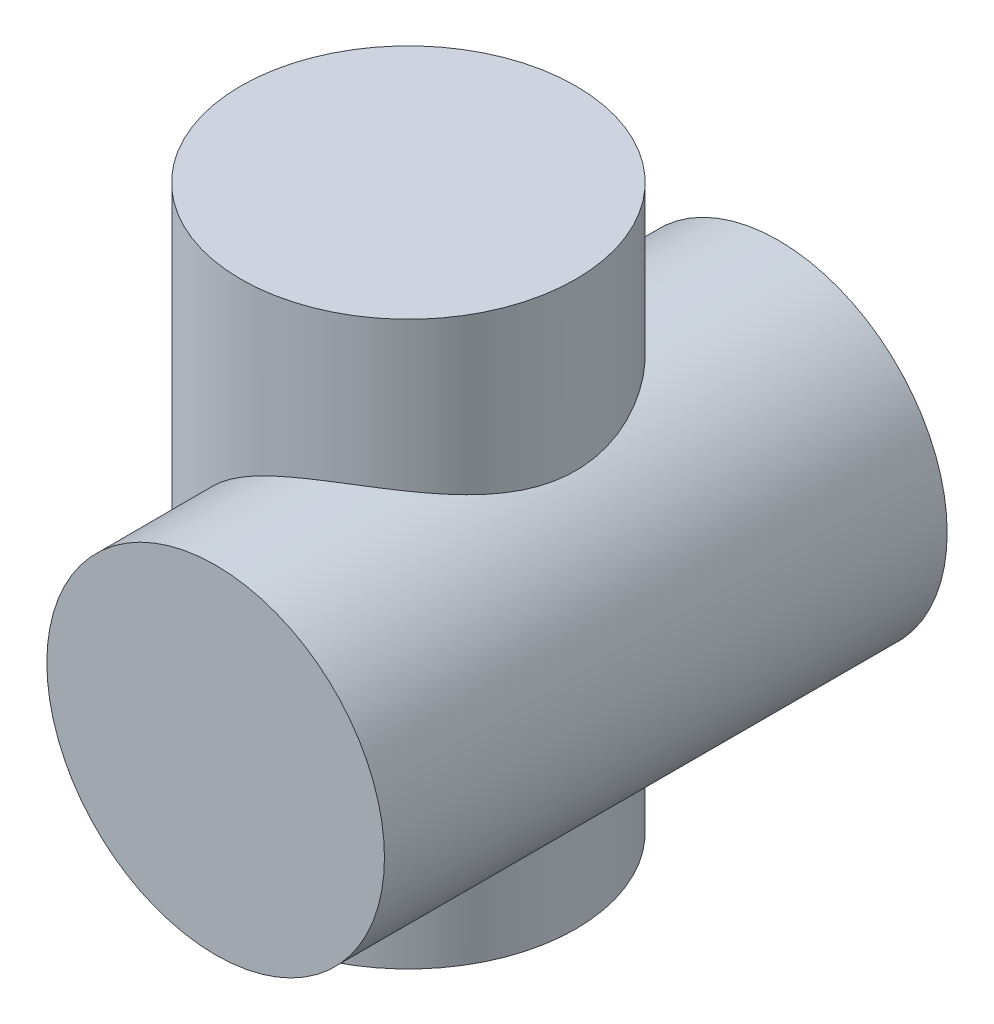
ISO-10303-21;
HEADER;
FILE_DESCRIPTION(('STEP AP214'),'2;1');
FILE_NAME('part.step','',(''),(''),'','','');
FILE_SCHEMA(('AUTOMOTIVE_DESIGN { 1 0 10303 214 1 1 1 1 }'));
ENDSEC;
DATA;
#1=APPLICATION_CONTEXT('core data for automotive mechanical design processes');
#2=APPLICATION_PROTOCOL_DEFINITION('international standard','automotive_design',2000,#1);
#3=PRODUCT_CONTEXT('',#1,'mechanical');
#4=PRODUCT('Part','Part','',(#3));
#5=PRODUCT_RELATED_PRODUCT_CATEGORY('part','',(#4));
#6=PRODUCT_DEFINITION_FORMATION('','',#4);
#7=PRODUCT_DEFINITION_CONTEXT('part definition',#1,'design');
#8=PRODUCT_DEFINITION('design','',#6,#7);
#9=PRODUCT_DEFINITION_SHAPE('','',#8);
#10=(LENGTH_UNIT() NAMED_UNIT(*) SI_UNIT(.MILLI.,.METRE.));
#11=(NAMED_UNIT(*) PLANE_ANGLE_UNIT() SI_UNIT($,.RADIAN.));
#12=(NAMED_UNIT(*) SI_UNIT($,.STERADIAN.) SOLID_ANGLE_UNIT());
#13=UNCERTAINTY_MEASURE_WITH_UNIT(LENGTH_MEASURE(1.E-05),#10,'distance_accuracy_value','');
#14=(GEOMETRIC_REPRESENTATION_CONTEXT(3) GLOBAL_UNCERTAINTY_ASSIGNED_CONTEXT((#13)) GLOBAL_UNIT_ASSIGNED_CONTEXT((#10,
#11,#12)) REPRESENTATION_CONTEXT('',''));
#15=CARTESIAN_POINT('',(0.,0.,0.));
#16=DIRECTION('',(0.,0.,1.));
#17=DIRECTION('',(1.,0.,0.));
#18=AXIS2_PLACEMENT_3D('',#15,#16,#17);
#19=CARTESIAN_POINT('',(0.,0.,50.));
#20=DIRECTION('',(0.,0.,-1.));
#21=DIRECTION('',(-1.,0.,0.));
#22=AXIS2_PLACEMENT_3D('',#19,#20,#21);
#23=CYLINDRICAL_SURFACE('',#22,15.);
#24=CARTESIAN_POINT('',(0.,0.,0.));
#25=DIRECTION('',(0.,0.,1.));
#26=DIRECTION('',(1.,0.,0.));
#27=AXIS2_PLACEMENT_3D('',#24,#25,#26);
#28=CIRCLE('',#27,15.);
#29=CARTESIAN_POINT('',(15.,0.,0.));
#30=VERTEX_POINT('',#29);
#31=EDGE_CURVE('E43',#30,#30,#28,.T.);
#32=ORIENTED_EDGE('',*,*,#31,.T.);
#33=EDGE_LOOP('',(#32));
#34=FACE_BOUND('',#33,.T.);
#35=CARTESIAN_POINT('',(0.,0.,50.));
#36=DIRECTION('',(0.,0.,1.));
#37=DIRECTION('',(1.,0.,0.));
#38=AXIS2_PLACEMENT_3D('',#35,#36,#37);
#39=CIRCLE('',#38,15.);
#40=CARTESIAN_POINT('',(15.,0.,50.));
#41=VERTEX_POINT('',#40);
#42=EDGE_CURVE('E39',#41,#41,#39,.T.);
#43=ORIENTED_EDGE('',*,*,#42,.F.);
#44=EDGE_LOOP('',(#43));
#45=FACE_BOUND('',#44,.T.);
#46=CARTESIAN_POINT('',(-15.,0.,38.0633261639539));
#47=CARTESIAN_POINT('',(-14.9999962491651,0.401423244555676,38.063333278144));
#48=CARTESIAN_POINT('',(-14.9838596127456,0.802976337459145,38.0721674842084));
#49=CARTESIAN_POINT('',(-14.9195113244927,1.60293446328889,38.1069437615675));
#50=CARTESIAN_POINT('',(-14.8712786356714,2.001337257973,38.132897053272));
#51=CARTESIAN_POINT('',(-14.7431941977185,2.79272154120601,38.200316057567));
#52=CARTESIAN_POINT('',(-14.6632628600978,3.18568678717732,38.2418208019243));
#53=CARTESIAN_POINT('',(-14.4727106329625,3.96239327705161,38.3377583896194));
#54=CARTESIAN_POINT('',(-14.3620936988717,4.34613570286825,38.3921895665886));
#55=CARTESIAN_POINT('',(-14.1120167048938,5.09976516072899,38.5104241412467));
#56=CARTESIAN_POINT('',(-13.9727479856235,5.46972580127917,38.5741645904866));
#57=CARTESIAN_POINT('',(-13.665880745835,6.19673046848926,38.7078473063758));
#58=CARTESIAN_POINT('',(-13.4982689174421,6.55376833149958,38.7777924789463));
#59=CARTESIAN_POINT('',(-13.1356851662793,7.25320417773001,38.9202230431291));
#60=CARTESIAN_POINT('',(-12.9407090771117,7.59559992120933,38.9927088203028));
#61=CARTESIAN_POINT('',(-12.5243113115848,8.26418370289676,39.1364679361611));
#62=CARTESIAN_POINT('',(-12.3028893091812,8.59037154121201,39.2077412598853));
#63=CARTESIAN_POINT('',(-11.8155335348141,9.25066802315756,39.3508391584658));
#64=CARTESIAN_POINT('',(-11.5474484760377,9.58328545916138,39.4222425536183));
#65=CARTESIAN_POINT('',(-10.9826399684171,10.2256800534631,39.5543295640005));
#66=CARTESIAN_POINT('',(-10.6859128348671,10.5354542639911,39.6150117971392));
#67=CARTESIAN_POINT('',(-10.0659494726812,11.1292684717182,39.7206330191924));
#68=CARTESIAN_POINT('',(-9.74275353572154,11.4133462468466,39.7655954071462));
#69=CARTESIAN_POINT('',(-9.07179090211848,11.9535730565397,39.8349699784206));
#70=CARTESIAN_POINT('',(-8.72403372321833,12.2097328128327,39.8593900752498));
#71=CARTESIAN_POINT('',(-8.09840812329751,12.6301034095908,39.879959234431));
#72=CARTESIAN_POINT('',(-7.82527435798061,12.8011247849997,39.8817211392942));
#73=CARTESIAN_POINT('',(-7.26884571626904,13.1250692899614,39.8693841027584));
#74=CARTESIAN_POINT('',(-6.98555307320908,13.2779963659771,39.855288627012));
#75=CARTESIAN_POINT('',(-6.41103039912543,13.5647224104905,39.8096367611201));
#76=CARTESIAN_POINT('',(-6.11980583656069,13.6985341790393,39.7780921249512));
#77=CARTESIAN_POINT('',(-5.53162484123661,13.9464321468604,39.6962303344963));
#78=CARTESIAN_POINT('',(-5.23466826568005,14.0605178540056,39.6459127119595));
#79=CARTESIAN_POINT('',(-4.63680881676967,14.2688651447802,39.525379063));
#80=CARTESIAN_POINT('',(-4.33589679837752,14.3630664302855,39.4551039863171));
#81=CARTESIAN_POINT('',(-3.73385454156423,14.5312083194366,39.2941961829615));
#82=CARTESIAN_POINT('',(-3.43272430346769,14.6051489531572,39.203563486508));
#83=CARTESIAN_POINT('',(-2.83305357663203,14.7332222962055,39.0018469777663));
#84=CARTESIAN_POINT('',(-2.5345136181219,14.7873510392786,38.8907590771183));
#85=CARTESIAN_POINT('',(-1.94282173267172,14.8766586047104,38.648484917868));
#86=CARTESIAN_POINT('',(-1.64966975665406,14.9118375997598,38.517298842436));
#87=CARTESIAN_POINT('',(-1.08325172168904,14.9634244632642,38.2413701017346));
#88=CARTESIAN_POINT('',(-0.809665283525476,14.980550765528,38.0974159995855));
#89=CARTESIAN_POINT('',(-0.271629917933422,14.9999562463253,37.7925023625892));
#90=CARTESIAN_POINT('',(-0.00718067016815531,15.0022359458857,37.6315434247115));
#91=CARTESIAN_POINT('',(0.511018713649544,14.9935328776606,37.2935493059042));
#92=CARTESIAN_POINT('',(0.764767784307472,14.9825487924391,37.116512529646));
#93=CARTESIAN_POINT('',(1.26026781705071,14.9490270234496,36.747367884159));
#94=CARTESIAN_POINT('',(1.50201721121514,14.9264878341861,36.5552580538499));
#95=CARTESIAN_POINT('',(1.99851181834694,14.8685953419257,36.1349265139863));
#96=CARTESIAN_POINT('',(2.25173393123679,14.8320998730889,35.9050613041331));
#97=CARTESIAN_POINT('',(2.74094029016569,14.7495363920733,35.4293483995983));
#98=CARTESIAN_POINT('',(2.97692356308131,14.7034678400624,35.1834998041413));
#99=CARTESIAN_POINT('',(3.65799314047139,14.554553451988,34.4235162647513));
#100=CARTESIAN_POINT('',(4.07610338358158,14.4410117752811,33.8870250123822));
#101=CARTESIAN_POINT('',(4.90294838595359,14.1838351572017,32.6621746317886));
#102=CARTESIAN_POINT('',(5.2964880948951,14.0384595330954,31.9638514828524));
#103=CARTESIAN_POINT('',(5.79967127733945,13.8346122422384,30.874181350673));
#104=CARTESIAN_POINT('',(5.95293428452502,13.7690024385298,30.5037257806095));
#105=CARTESIAN_POINT('',(6.22946729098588,13.6461228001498,29.750316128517));
#106=CARTESIAN_POINT('',(6.35273749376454,13.5888529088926,29.3673621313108));
#107=CARTESIAN_POINT('',(6.57342708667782,13.4835372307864,28.5722296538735));
#108=CARTESIAN_POINT('',(6.66928579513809,13.4360801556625,28.1595382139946));
#109=CARTESIAN_POINT('',(6.8256221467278,13.3573417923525,27.3259387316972));
#110=CARTESIAN_POINT('',(6.8860992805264,13.326060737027,26.9050305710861));
#111=CARTESIAN_POINT('',(6.9707738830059,13.2819656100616,26.0590181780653));
#112=CARTESIAN_POINT('',(6.99500692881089,13.2691334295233,25.6339184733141));
#113=CARTESIAN_POINT('',(7.00692743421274,13.2628441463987,24.7830865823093));
#114=CARTESIAN_POINT('',(6.9946185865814,13.2693850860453,24.3573544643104));
#115=CARTESIAN_POINT('',(6.93704208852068,13.2995604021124,23.5562115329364));
#116=CARTESIAN_POINT('',(6.89557198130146,13.3212233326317,23.1804450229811));
#117=CARTESIAN_POINT('',(6.7843862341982,13.3781913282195,22.4341996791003));
#118=CARTESIAN_POINT('',(6.71467260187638,13.4134954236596,22.0637204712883));
#119=CARTESIAN_POINT('',(6.54766956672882,13.495801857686,21.3301646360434));
#120=CARTESIAN_POINT('',(6.4503646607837,13.5428107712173,20.96709229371));
#121=CARTESIAN_POINT('',(6.22903506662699,13.6460255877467,20.2505316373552));
#122=CARTESIAN_POINT('',(6.1050087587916,13.702232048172,19.8970439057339));
#123=CARTESIAN_POINT('',(5.82651813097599,13.8230052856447,19.1896869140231));
#124=CARTESIAN_POINT('',(5.67117303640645,13.8877891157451,18.836201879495));
#125=CARTESIAN_POINT('',(5.33373071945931,14.0208492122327,18.142740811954));
#126=CARTESIAN_POINT('',(5.15162155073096,14.0891270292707,17.8027708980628));
#127=CARTESIAN_POINT('',(4.76143938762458,14.225731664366,17.1377511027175));
#128=CARTESIAN_POINT('',(4.55334849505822,14.2940584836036,16.8127117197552));
#129=CARTESIAN_POINT('',(4.11217246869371,14.4271661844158,16.1792965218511));
#130=CARTESIAN_POINT('',(3.87908754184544,14.4919470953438,15.8709205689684));
#131=CARTESIAN_POINT('',(3.36425406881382,14.6205011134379,15.2423830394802));
#132=CARTESIAN_POINT('',(3.07996963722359,14.6835230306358,14.9241359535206));
#133=CARTESIAN_POINT('',(2.4837011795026,14.7960557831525,14.3119784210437));
#134=CARTESIAN_POINT('',(2.17171330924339,14.8455647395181,14.0180713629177));
#135=CARTESIAN_POINT('',(1.52266635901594,14.926092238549,13.4576993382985));
#136=CARTESIAN_POINT('',(1.18565220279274,14.9571430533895,13.191187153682));
#137=CARTESIAN_POINT('',(0.488950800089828,14.9960822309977,12.6878182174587));
#138=CARTESIAN_POINT('',(0.129273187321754,15.003980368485,12.4509489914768));
#139=CARTESIAN_POINT('',(-0.510919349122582,14.9937509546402,12.0680692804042));
#140=CARTESIAN_POINT('',(-0.787121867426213,14.981971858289,11.9146253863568));
#141=CARTESIAN_POINT('',(-1.347765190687,14.9419693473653,11.6260668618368));
#142=CARTESIAN_POINT('',(-1.63220423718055,14.9137494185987,11.4909483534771));
#143=CARTESIAN_POINT('',(-2.20695299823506,14.8395843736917,11.2398343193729));
#144=CARTESIAN_POINT('',(-2.49725904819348,14.7936500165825,11.1238272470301));
#145=CARTESIAN_POINT('',(-3.08144003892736,14.6830885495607,10.9112769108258));
#146=CARTESIAN_POINT('',(-3.37531509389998,14.6184608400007,10.814734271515));
#147=CARTESIAN_POINT('',(-3.96441152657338,14.4698256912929,10.6410791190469));
#148=CARTESIAN_POINT('',(-4.25963425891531,14.3857894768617,10.5639958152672));
#149=CARTESIAN_POINT('',(-4.84828338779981,14.1982241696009,10.4291324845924));
#150=CARTESIAN_POINT('',(-5.14170978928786,14.0946951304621,10.3713524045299));
#151=CARTESIAN_POINT('',(-5.7242436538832,13.8683350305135,10.2743556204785));
#152=CARTESIAN_POINT('',(-6.01334975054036,13.7454979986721,10.2351446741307));
#153=CARTESIAN_POINT('',(-6.58474726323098,13.4811057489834,10.1742116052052));
#154=CARTESIAN_POINT('',(-6.8670386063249,13.3395503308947,10.152489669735));
#155=CARTESIAN_POINT('',(-7.41925227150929,13.0404024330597,10.1252919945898));
#156=CARTESIAN_POINT('',(-7.68928433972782,12.8830297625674,10.119618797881));
#157=CARTESIAN_POINT('',(-8.21891395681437,12.5517736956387,10.1223704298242));
#158=CARTESIAN_POINT('',(-8.47851166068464,12.3778905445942,10.1307950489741));
#159=CARTESIAN_POINT('',(-8.9858713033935,12.0146355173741,10.1600112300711));
#160=CARTESIAN_POINT('',(-9.23363340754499,11.8252638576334,10.1808026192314));
#161=CARTESIAN_POINT('',(-9.71629798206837,11.4319952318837,10.2329454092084));
#162=CARTESIAN_POINT('',(-9.95119550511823,11.2280927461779,10.2643008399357));
#163=CARTESIAN_POINT('',(-10.4382221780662,10.778120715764,10.3405822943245));
#164=CARTESIAN_POINT('',(-10.6883422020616,10.5300901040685,10.3867748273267));
#165=CARTESIAN_POINT('',(-11.1697526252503,10.0179923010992,10.487674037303));
#166=CARTESIAN_POINT('',(-11.4010405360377,9.75392299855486,10.5423818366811));
#167=CARTESIAN_POINT('',(-11.8441708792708,9.21078491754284,10.6576490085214));
#168=CARTESIAN_POINT('',(-12.0559967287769,8.93170366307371,10.7182132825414));
#169=CARTESIAN_POINT('',(-12.4593495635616,8.35984907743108,10.8424801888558));
#170=CARTESIAN_POINT('',(-12.6508726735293,8.06707314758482,10.906183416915));
#171=CARTESIAN_POINT('',(-13.0453207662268,7.41548273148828,11.0454964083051));
#172=CARTESIAN_POINT('',(-13.2441726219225,7.05421292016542,11.1212006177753));
#173=CARTESIAN_POINT('',(-13.6116662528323,6.31604954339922,11.2689742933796));
#174=CARTESIAN_POINT('',(-13.7803170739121,5.93916069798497,11.3410448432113));
#175=CARTESIAN_POINT('',(-14.0863661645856,5.17155328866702,11.4774306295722));
#176=CARTESIAN_POINT('',(-14.223767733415,4.7808361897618,11.5417466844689));
#177=CARTESIAN_POINT('',(-14.4661556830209,3.98776086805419,11.6587472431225));
#178=CARTESIAN_POINT('',(-14.5711438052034,3.5854032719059,11.7114323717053));
#179=CARTESIAN_POINT('',(-14.7484661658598,2.76758721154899,11.8022445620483));
#180=CARTESIAN_POINT('',(-14.8204598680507,2.35203746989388,11.8402192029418));
#181=CARTESIAN_POINT('',(-14.9292519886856,1.5150860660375,11.8981976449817));
#182=CARTESIAN_POINT('',(-14.9660506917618,1.09368445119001,11.9182015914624));
#183=CARTESIAN_POINT('',(-15.0038840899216,0.249077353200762,11.9387744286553));
#184=CARTESIAN_POINT('',(-15.0049425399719,-0.174126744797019,11.9393562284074));
#185=CARTESIAN_POINT('',(-14.9713354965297,-1.01866623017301,11.9210702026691));
#186=CARTESIAN_POINT('',(-14.9366724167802,-1.44000174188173,11.9022036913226));
#187=CARTESIAN_POINT('',(-14.8380513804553,-2.22988360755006,11.8495573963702));
#188=CARTESIAN_POINT('',(-14.7778297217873,-2.59903403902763,11.8176951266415));
#189=CARTESIAN_POINT('',(-14.630335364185,-3.33053814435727,11.7415261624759));
#190=CARTESIAN_POINT('',(-14.5430648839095,-3.69289237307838,11.6972204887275));
#191=CARTESIAN_POINT('',(-14.3422098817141,-4.40901492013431,11.5984523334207));
#192=CARTESIAN_POINT('',(-14.2286102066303,-4.76277816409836,11.543984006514));
#193=CARTESIAN_POINT('',(-13.975965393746,-5.45983966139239,11.4276006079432));
#194=CARTESIAN_POINT('',(-13.8369183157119,-5.80313711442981,11.3656849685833));
#195=CARTESIAN_POINT('',(-13.5236092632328,-6.50142301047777,11.2328284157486));
#196=CARTESIAN_POINT('',(-13.3475643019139,-6.85554933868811,11.1615591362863));
#197=CARTESIAN_POINT('',(-12.9681725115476,-7.54868601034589,11.0175231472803));
#198=CARTESIAN_POINT('',(-12.7648166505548,-7.88769130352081,10.9447559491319));
#199=CARTESIAN_POINT('',(-12.3315964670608,-8.54915902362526,10.8014983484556));
#200=CARTESIAN_POINT('',(-12.1017154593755,-8.87161085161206,10.7310094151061));
#201=CARTESIAN_POINT('',(-11.6164460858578,-9.4981690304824,10.5962128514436));
#202=CARTESIAN_POINT('',(-11.3610547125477,-9.80227321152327,10.5319059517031));
#203=CARTESIAN_POINT('',(-10.8042163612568,-10.4141008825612,10.4086116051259));
#204=CARTESIAN_POINT('',(-10.5007158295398,-10.7201350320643,10.3504725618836));
#205=CARTESIAN_POINT('',(-9.86710264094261,-11.3060305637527,10.2510291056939));
#206=CARTESIAN_POINT('',(-9.53700455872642,-11.5859061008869,10.2097155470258));
#207=CARTESIAN_POINT('',(-8.85293553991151,-12.1166275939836,10.1488843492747));
#208=CARTESIAN_POINT('',(-8.49899511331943,-12.3675095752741,10.1293393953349));
#209=CARTESIAN_POINT('',(-7.77034757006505,-12.8378170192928,10.1167182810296));
#210=CARTESIAN_POINT('',(-7.3956463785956,-13.0572513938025,10.1236346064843));
#211=CARTESIAN_POINT('',(-6.68589237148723,-13.4326376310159,10.1649099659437));
#212=CARTESIAN_POINT('',(-6.3530209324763,-13.593180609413,10.1951221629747));
#213=CARTESIAN_POINT('',(-5.67897645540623,-13.8882865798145,10.280089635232));
#214=CARTESIAN_POINT('',(-5.3378042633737,-14.022852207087,10.3348424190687));
#215=CARTESIAN_POINT('',(-4.65146000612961,-14.2652124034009,10.4703625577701));
#216=CARTESIAN_POINT('',(-4.30629143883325,-14.3730287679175,10.5511086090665));
#217=CARTESIAN_POINT('',(-3.61599529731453,-14.5620256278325,10.7394097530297));
#218=CARTESIAN_POINT('',(-3.27086772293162,-14.6432091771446,10.8469617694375));
#219=CARTESIAN_POINT('',(-2.63864870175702,-14.7690429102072,11.0699258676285));
#220=CARTESIAN_POINT('',(-2.35092222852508,-14.8174210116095,11.1814780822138));
#221=CARTESIAN_POINT('',(-1.78100237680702,-14.8966699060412,11.4232523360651));
#222=CARTESIAN_POINT('',(-1.49880824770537,-14.9275430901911,11.5534718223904));
#223=CARTESIAN_POINT('',(-0.942093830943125,-14.9729919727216,11.831939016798));
#224=CARTESIAN_POINT('',(-0.667574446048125,-14.9875657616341,11.9801888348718));
#225=CARTESIAN_POINT('',(-0.12812335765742,-15.0018801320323,12.2938400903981));
#226=CARTESIAN_POINT('',(0.136807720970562,-15.001619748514,12.459242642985));
#227=CARTESIAN_POINT('',(0.664350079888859,-14.9876820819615,12.8121368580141));
#228=CARTESIAN_POINT('',(0.926573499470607,-14.9735471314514,13.0001897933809));
#229=CARTESIAN_POINT('',(1.43762306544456,-14.9331506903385,13.392392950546));
#230=CARTESIAN_POINT('',(1.6864491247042,-14.9068891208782,13.5965432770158));
#231=CARTESIAN_POINT('',(2.41123746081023,-14.8129376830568,14.2315361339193));
#232=CARTESIAN_POINT('',(2.8656518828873,-14.730075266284,14.6850158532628));
#233=CARTESIAN_POINT('',(3.78141188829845,-14.5243594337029,15.7245019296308));
#234=CARTESIAN_POINT('',(4.23103593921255,-14.3971212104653,16.3199654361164));
#235=CARTESIAN_POINT('',(4.83462438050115,-14.2011011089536,17.25728533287));
#236=CARTESIAN_POINT('',(5.02414730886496,-14.1348403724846,17.5773788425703));
#237=CARTESIAN_POINT('',(5.37885839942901,-14.0037003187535,18.2311666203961));
#238=CARTESIAN_POINT('',(5.54404508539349,-13.9388210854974,18.564861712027));
#239=CARTESIAN_POINT('',(5.86991597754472,-13.8050431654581,19.2905232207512));
#240=CARTESIAN_POINT('',(6.02695038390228,-13.7367929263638,19.6842542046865));
#241=CARTESIAN_POINT('',(6.30727240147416,-13.6103632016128,20.4851922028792));
#242=CARTESIAN_POINT('',(6.43055724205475,-13.5521845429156,20.8924003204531));
#243=CARTESIAN_POINT('',(6.64197728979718,-13.4498309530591,21.7170918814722));
#244=CARTESIAN_POINT('',(6.73015337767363,-13.4056397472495,22.1345627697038));
#245=CARTESIAN_POINT('',(6.87043472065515,-13.3342930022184,22.9769482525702));
#246=CARTESIAN_POINT('',(6.92254485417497,-13.3071351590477,23.4018618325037));
#247=CARTESIAN_POINT('',(6.98762005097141,-13.2730703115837,24.2258747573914));
#248=CARTESIAN_POINT('',(7.00304140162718,-13.2648935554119,24.624728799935));
#249=CARTESIAN_POINT('',(7.00177758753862,-13.2655614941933,25.4223663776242));
#250=CARTESIAN_POINT('',(6.98509354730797,-13.2744055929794,25.8211499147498));
#251=CARTESIAN_POINT('',(6.91984151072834,-13.308535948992,26.615447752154));
#252=CARTESIAN_POINT('',(6.87126724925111,-13.3338254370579,27.0109613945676));
#253=CARTESIAN_POINT('',(6.74284496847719,-13.3992243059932,27.7956136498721));
#254=CARTESIAN_POINT('',(6.66299668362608,-13.4393338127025,28.1847522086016));
#255=CARTESIAN_POINT('',(6.47855465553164,-13.5291602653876,28.9311749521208));
#256=CARTESIAN_POINT('',(6.37570853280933,-13.5781666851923,29.2889799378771));
#257=CARTESIAN_POINT('',(6.14397099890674,-13.6845849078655,29.9947290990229));
#258=CARTESIAN_POINT('',(6.01508093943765,-13.7419962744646,30.3426737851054));
#259=CARTESIAN_POINT('',(5.73198973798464,-13.862465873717,31.0274024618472));
#260=CARTESIAN_POINT('',(5.57776921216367,-13.9255284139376,31.3641776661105));
#261=CARTESIAN_POINT('',(5.24489283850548,-14.0542854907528,32.0249125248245));
#262=CARTESIAN_POINT('',(5.06623538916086,-14.1199801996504,32.3488713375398));
#263=CARTESIAN_POINT('',(4.66309334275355,-14.2585453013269,33.0195226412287));
#264=CARTESIAN_POINT('',(4.43569576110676,-14.3313621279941,33.3644803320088));
#265=CARTESIAN_POINT('',(3.95244174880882,-14.472095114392,34.0349948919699));
#266=CARTESIAN_POINT('',(3.69658174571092,-14.5400106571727,34.3605493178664));
#267=CARTESIAN_POINT('',(3.15780357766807,-14.6664509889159,34.9900086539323));
#268=CARTESIAN_POINT('',(2.87490602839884,-14.7249828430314,35.2939297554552));
#269=CARTESIAN_POINT('',(2.28339884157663,-14.8282215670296,35.8781551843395));
#270=CARTESIAN_POINT('',(1.97479581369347,-14.8729319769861,36.1584655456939));
#271=CARTESIAN_POINT('',(1.39667329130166,-14.9370860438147,36.6407269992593));
#272=CARTESIAN_POINT('',(1.13133531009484,-14.9597631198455,36.8472732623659));
#273=CARTESIAN_POINT('',(0.58673675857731,-14.991000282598,37.2422539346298));
#274=CARTESIAN_POINT('',(0.307478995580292,-14.9995632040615,37.430691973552));
#275=CARTESIAN_POINT('',(-0.263028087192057,-15.0004038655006,37.7880726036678));
#276=CARTESIAN_POINT('',(-0.554268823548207,-14.9926930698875,37.9570288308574));
#277=CARTESIAN_POINT('',(-1.14674600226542,-14.9590439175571,38.274425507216));
#278=CARTESIAN_POINT('',(-1.44798255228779,-14.9331053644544,38.4228657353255));
#279=CARTESIAN_POINT('',(-2.05950050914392,-14.861148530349,38.6990223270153));
#280=CARTESIAN_POINT('',(-2.3698221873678,-14.8150218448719,38.8266216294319));
#281=CARTESIAN_POINT('',(-2.99491729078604,-14.7014069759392,39.059496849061));
#282=CARTESIAN_POINT('',(-3.30969071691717,-14.6339187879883,39.164772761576));
#283=CARTESIAN_POINT('',(-3.94039814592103,-14.4768388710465,39.3528386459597));
#284=CARTESIAN_POINT('',(-4.25633201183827,-14.3872496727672,39.435631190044));
#285=CARTESIAN_POINT('',(-4.88607361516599,-14.1857519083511,39.5791203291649));
#286=CARTESIAN_POINT('',(-5.19988146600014,-14.0738445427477,39.6398181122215));
#287=CARTESIAN_POINT('',(-5.79523824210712,-13.8386647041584,39.7357012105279));
#288=CARTESIAN_POINT('',(-6.07722903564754,-13.7172133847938,39.7726395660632));
#289=CARTESIAN_POINT('',(-6.63454924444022,-13.4564998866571,39.8299060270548));
#290=CARTESIAN_POINT('',(-6.90987911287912,-13.317238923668,39.8502352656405));
#291=CARTESIAN_POINT('',(-7.45197000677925,-13.0216541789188,39.8756166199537));
#292=CARTESIAN_POINT('',(-7.71872988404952,-12.8653281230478,39.8806666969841));
#293=CARTESIAN_POINT('',(-8.24200499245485,-12.5365407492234,39.8770246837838));
#294=CARTESIAN_POINT('',(-8.49851961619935,-12.3640784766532,39.8683317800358));
#295=CARTESIAN_POINT('',(-9.01635003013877,-11.9922297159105,39.8379161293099));
#296=CARTESIAN_POINT('',(-9.27688234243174,-11.7918199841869,39.8153782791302));
#297=CARTESIAN_POINT('',(-9.78347832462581,-11.3750238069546,39.758734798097));
#298=CARTESIAN_POINT('',(-10.0295415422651,-11.1586368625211,39.7246288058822));
#299=CARTESIAN_POINT('',(-10.5062722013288,-10.7109848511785,39.6470094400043));
#300=CARTESIAN_POINT('',(-10.7369350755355,-10.4797154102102,39.6034932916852));
#301=CARTESIAN_POINT('',(-11.1820810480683,-10.0033686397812,39.5092225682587));
#302=CARTESIAN_POINT('',(-11.3965584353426,-9.75828648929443,39.4584654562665));
#303=CARTESIAN_POINT('',(-11.8455971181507,-9.21025591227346,39.3423237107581));
#304=CARTESIAN_POINT('',(-12.0768629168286,-8.90481183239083,39.2759482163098));
#305=CARTESIAN_POINT('',(-12.5150562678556,-8.2776650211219,39.1396542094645));
#306=CARTESIAN_POINT('',(-12.7219808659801,-7.95596032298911,39.0697352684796));
#307=CARTESIAN_POINT('',(-13.1108696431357,-7.29736176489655,38.9297459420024));
#308=CARTESIAN_POINT('',(-13.292807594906,-6.9604524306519,38.8596754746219));
#309=CARTESIAN_POINT('',(-13.6305733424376,-6.27327565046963,38.7228939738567));
#310=CARTESIAN_POINT('',(-13.7864104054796,-5.92301300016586,38.6561817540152));
#311=CARTESIAN_POINT('',(-14.0720003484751,-5.20842694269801,38.5290278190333));
#312=CARTESIAN_POINT('',(-14.2015946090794,-4.84403301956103,38.4686252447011));
#313=CARTESIAN_POINT('',(-14.4326040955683,-4.10485878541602,38.3577082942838));
#314=CARTESIAN_POINT('',(-14.5340153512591,-3.73007701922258,38.3071953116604));
#315=CARTESIAN_POINT('',(-14.7074615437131,-2.97335717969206,38.2190015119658));
#316=CARTESIAN_POINT('',(-14.779574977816,-2.59144113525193,38.1812864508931));
#317=CARTESIAN_POINT('',(-14.8939843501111,-1.82216022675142,38.1207407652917));
#318=CARTESIAN_POINT('',(-14.9362989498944,-1.43479892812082,38.0979008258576));
#319=CARTESIAN_POINT('',(-14.9756393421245,-0.872176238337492,38.0765857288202));
#320=CARTESIAN_POINT('',(-14.9847707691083,-0.69792015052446,38.0716208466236));
#321=CARTESIAN_POINT('',(-14.996952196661,-0.349117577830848,38.064989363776));
#322=CARTESIAN_POINT('',(-15.0000016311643,-0.174571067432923,38.0633230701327));
#323=CARTESIAN_POINT('',(-15.,0.,38.0633261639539));
#324=B_SPLINE_CURVE_WITH_KNOTS('',3,(#46,#47,#48,#49,#50,#51,#52,#53,#54,#55,#56,#57,#58,#59,
#60,#61,#62,#63,#64,#65,#66,#67,#68,#69,#70,#71,#72,#73,#74,#75,#76,#77,#78,#79,#80,#81,#82,#83,
#84,#85,#86,#87,#88,#89,#90,#91,#92,#93,#94,#95,#96,#97,#98,#99,#100,#101,#102,#103,#104,#105,
#106,#107,#108,#109,#110,#111,#112,#113,#114,#115,#116,#117,#118,#119,#120,#121,#122,#123,#124,
#125,#126,#127,#128,#129,#130,#131,#132,#133,#134,#135,#136,#137,#138,#139,#140,#141,#142,#143,
#144,#145,#146,#147,#148,#149,#150,#151,#152,#153,#154,#155,#156,#157,#158,#159,#160,#161,#162,
#163,#164,#165,#166,#167,#168,#169,#170,#171,#172,#173,#174,#175,#176,#177,#178,#179,#180,#181,
#182,#183,#184,#185,#186,#187,#188,#189,#190,#191,#192,#193,#194,#195,#196,#197,#198,#199,#200,
#201,#202,#203,#204,#205,#206,#207,#208,#209,#210,#211,#212,#213,#214,#215,#216,#217,#218,#219,
#220,#221,#222,#223,#224,#225,#226,#227,#228,#229,#230,#231,#232,#233,#234,#235,#236,#237,#238,
#239,#240,#241,#242,#243,#244,#245,#246,#247,#248,#249,#250,#251,#252,#253,#254,#255,#256,#257,
#258,#259,#260,#261,#262,#263,#264,#265,#266,#267,#268,#269,#270,#271,#272,#273,#274,#275,#276,
#277,#278,#279,#280,#281,#282,#283,#284,#285,#286,#287,#288,#289,#290,#291,#292,#293,#294,#295,
#296,#297,#298,#299,#300,#301,#302,#303,#304,#305,#306,#307,#308,#309,#310,#311,#312,#313,#314,
#315,#316,#317,#318,#319,#320,#321,#322,#323),.UNSPECIFIED.,.T.,.F.,(4,2,2,2,2,2,2,2,2,2,2,2,2,
2,2,2,2,2,2,2,2,2,2,2,2,2,2,2,2,2,2,2,2,2,2,2,2,2,2,2,2,2,2,2,2,2,2,2,2,2,2,2,2,2,2,2,2,2,2,2,2,
2,2,2,2,2,2,2,2,2,2,2,2,2,2,2,2,2,2,2,2,2,2,2,2,2,2,2,2,2,2,2,2,2,2,2,2,2,2,2,2,2,2,2,2,2,2,2,2,
2,2,2,2,2,2,2,2,2,2,2,2,2,2,2,2,2,2,2,2,2,2,2,2,2,2,2,2,2,4),(0.,1.20407935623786,
2.40894869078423,3.61686254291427,4.82462076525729,6.02456099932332,7.2250662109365,
8.42575440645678,9.62645740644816,10.9242213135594,12.2221523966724,13.518143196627,
14.8136345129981,15.7794592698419,16.7450729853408,17.7100370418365,18.6750251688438,
19.6428988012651,20.6107709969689,21.5788368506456,22.5468938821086,23.4747753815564,
24.4026243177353,25.3305654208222,26.2586274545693,27.2894081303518,28.3202469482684,
30.3823002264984,32.815015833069,34.0326260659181,35.2502280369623,36.5274289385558,
37.8046482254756,39.0806129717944,40.3564487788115,41.4911151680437,42.6257009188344,
43.7609254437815,44.8962187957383,46.069559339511,47.2434252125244,48.4181042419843,
49.5927735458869,50.8851283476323,52.1776627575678,53.4679306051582,54.7576536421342,
55.7052283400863,56.6526022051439,57.599401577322,58.5462313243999,59.494473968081,
60.4427139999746,61.3912478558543,62.3397918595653,63.2766135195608,64.2134212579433,
65.1502159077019,66.087368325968,67.1521332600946,68.2170386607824,69.2828431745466,
70.3488507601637,71.6052530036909,72.8612782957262,74.1171709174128,75.3729960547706,
76.6415058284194,77.9100053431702,79.1776617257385,80.4452324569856,81.5701358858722,
82.6949470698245,83.8204072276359,84.9459532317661,86.150235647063,87.3549173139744,
88.5603609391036,89.7659468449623,91.0688485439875,92.3710410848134,93.6715978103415,
94.9717852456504,96.082464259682,97.1930305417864,98.3026889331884,99.412220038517,
100.348227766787,101.284107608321,102.220097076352,103.156147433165,104.124148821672,
105.092156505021,107.027663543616,109.289139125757,110.421860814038,111.554651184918,
112.841091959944,114.12763831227,115.412682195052,116.697552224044,117.89363053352,
119.089666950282,120.285938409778,121.482220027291,122.607582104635,123.732885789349,
124.85905464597,125.98529734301,127.242456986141,128.49977459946,129.756141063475,
131.012185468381,132.022250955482,133.032113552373,134.041264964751,135.050427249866,
136.065076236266,137.079725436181,138.09425850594,139.108737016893,140.035438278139,
140.962076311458,141.888837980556,142.815654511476,143.803095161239,144.790566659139,
145.778329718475,146.766439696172,147.93174243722,149.097186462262,150.26384459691,
151.430087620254,152.603182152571,153.776441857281,154.946536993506,156.115898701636,
156.639480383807,157.163110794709),.UNSPECIFIED.);
#325=CARTESIAN_POINT('',(-15.,0.,38.0633261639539));
#326=VERTEX_POINT('',#325);
#327=EDGE_CURVE('E10',#326,#326,#324,.T.);
#328=ORIENTED_EDGE('',*,*,#327,.F.);
#329=EDGE_LOOP('',(#328));
#330=FACE_BOUND('',#329,.T.);
#331=ADVANCED_FACE('F29',(#34,#45,#330),#23,.T.);
#332=CARTESIAN_POINT('',(0.,0.,50.));
#333=DIRECTION('',(0.,0.,1.));
#334=DIRECTION('',(1.,0.,0.));
#335=AXIS2_PLACEMENT_3D('',#332,#333,#334);
#336=PLANE('',#335);
#337=ORIENTED_EDGE('',*,*,#42,.T.);
#338=EDGE_LOOP('',(#337));
#339=FACE_BOUND('',#338,.T.);
#340=ADVANCED_FACE('F68',(#339),#336,.T.);
#341=CARTESIAN_POINT('',(0.,0.,0.));
#342=DIRECTION('',(0.,0.,1.));
#343=DIRECTION('',(1.,0.,0.));
#344=AXIS2_PLACEMENT_3D('',#341,#342,#343);
#345=PLANE('',#344);
#346=ORIENTED_EDGE('',*,*,#31,.F.);
#347=EDGE_LOOP('',(#346));
#348=FACE_BOUND('',#347,.T.);
#349=ADVANCED_FACE('F60',(#348),#345,.F.);
#350=CARTESIAN_POINT('',(-7.87677816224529,28.,25.));
#351=DIRECTION('',(0.,-1.,0.));
#352=DIRECTION('',(0.,0.,-1.));
#353=AXIS2_PLACEMENT_3D('',#350,#351,#352);
#354=CYLINDRICAL_SURFACE('',#353,14.8792062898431);
#355=CARTESIAN_POINT('',(-7.87677816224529,-22.,25.));
#356=DIRECTION('',(0.,1.,0.));
#357=DIRECTION('',(0.,0.,1.));
#358=AXIS2_PLACEMENT_3D('',#355,#356,#357);
#359=CIRCLE('',#358,14.8792062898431);
#360=CARTESIAN_POINT('',(-7.87677816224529,-22.,39.8792062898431));
#361=VERTEX_POINT('',#360);
#362=EDGE_CURVE('E50',#361,#361,#359,.T.);
#363=ORIENTED_EDGE('',*,*,#362,.T.);
#364=EDGE_LOOP('',(#363));
#365=FACE_BOUND('',#364,.T.);
#366=CARTESIAN_POINT('',(-7.87677816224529,28.,25.));
#367=DIRECTION('',(0.,1.,0.));
#368=DIRECTION('',(0.,0.,1.));
#369=AXIS2_PLACEMENT_3D('',#366,#367,#368);
#370=CIRCLE('',#369,14.8792062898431);
#371=CARTESIAN_POINT('',(-7.87677816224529,28.,39.8792062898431));
#372=VERTEX_POINT('',#371);
#373=EDGE_CURVE('E48',#372,#372,#370,.T.);
#374=ORIENTED_EDGE('',*,*,#373,.F.);
#375=EDGE_LOOP('',(#374));
#376=FACE_BOUND('',#375,.T.);
#377=ORIENTED_EDGE('',*,*,#327,.T.);
#378=EDGE_LOOP('',(#377));
#379=FACE_BOUND('',#378,.T.);
#380=ADVANCED_FACE('F58',(#365,#376,#379),#354,.T.);
#381=CARTESIAN_POINT('',(-7.87677816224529,28.,25.));
#382=DIRECTION('',(0.,1.,0.));
#383=DIRECTION('',(0.,0.,1.));
#384=AXIS2_PLACEMENT_3D('',#381,#382,#383);
#385=PLANE('',#384);
#386=ORIENTED_EDGE('',*,*,#373,.T.);
#387=EDGE_LOOP('',(#386));
#388=FACE_BOUND('',#387,.T.);
#389=ADVANCED_FACE('F56',(#388),#385,.T.);
#390=CARTESIAN_POINT('',(-7.87677816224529,-22.,25.));
#391=DIRECTION('',(0.,1.,0.));
#392=DIRECTION('',(0.,0.,1.));
#393=AXIS2_PLACEMENT_3D('',#390,#391,#392);
#394=PLANE('',#393);
#395=ORIENTED_EDGE('',*,*,#362,.F.);
#396=EDGE_LOOP('',(#395));
#397=FACE_BOUND('',#396,.T.);
#398=ADVANCED_FACE('F66',(#397),#394,.F.);
#399=CLOSED_SHELL('',(#331,#340,#349,#380,#389,#398));
#400=MANIFOLD_SOLID_BREP('B2',#399);
#401=ADVANCED_BREP_SHAPE_REPRESENTATION('',(#18,#400),#14);
#402=SHAPE_DEFINITION_REPRESENTATION(#9,#401);
ENDSEC;
END-ISO-10303-21;
